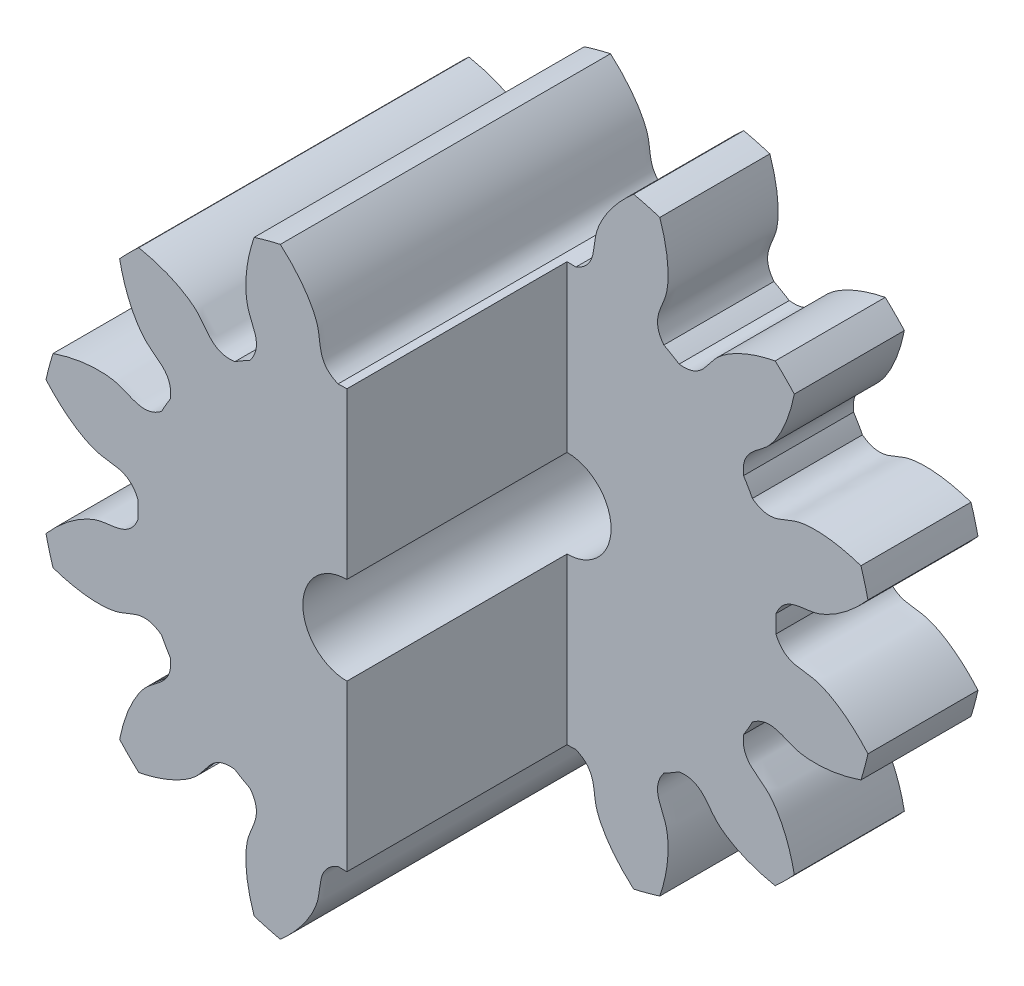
from build123d import *

# Parameters (mm, degrees)
SKETCH_1_R               = 14
EXTRUDE_1_DEPTH          = 15
CUT_EXTRUDE_1_DEPTH      = 25.839484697
PATTERN_CIRCULAR_1_COUNT = 12
CUT_EXTRUDE_START        = -10
CUT_EXTRUDE_3_DEPTH      = 10
CUT_EXTRUDE_4_REACH      = 26.468
SKETCH_4_R               = 2


with BuildPart() as part:
    # Sketch 1 → Extrude 1 (new body)
    with BuildSketch(Plane.XY):
        Circle(SKETCH_1_R)
    extrude(amount=EXTRUDE_1_DEPTH)

    # Sketch 2 → Cut-Extrude 1 (cut, through all)
    with BuildSketch(Plane.XY):
        with BuildLine():
            ThreePointArc((0.401680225, 9.491504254), (0, 9.5), (-0.401680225, 9.491504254))
            add(Edge.make_bspline(
                [(-0.401680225, 9.491504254), (-1.361577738, 9.898614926), (-1.148746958, 10.689637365), (-1.352304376, 11.378961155), (-1.365247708, 11.419811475), (-1.380454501, 11.46466685), (-1.398085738, 11.513452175), (-1.41830525, 11.566086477), (-1.441273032, 11.622484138), (-1.467147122, 11.682554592), (-1.496082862, 11.746202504), (-1.528232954, 11.813327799), (-1.563747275, 11.883825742), (-1.602772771, 11.957587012), (-1.645453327, 12.034497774), (-1.691929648, 12.114439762), (-1.742339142, 12.197290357), (-1.796815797, 12.282922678), (-1.855490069, 12.371205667), (-1.918488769, 12.462004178), (-1.985934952, 12.555179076), (-2.057947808, 12.650587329), (-2.134642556, 12.748082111), (-2.216130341, 12.847512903), (-2.302518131, 12.948725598), (-2.39390862, 13.051562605), (-2.490400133, 13.155862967), (-2.59208653, 13.261462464), (-2.699057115, 13.368193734), (-2.811396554, 13.475886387), (-2.929184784, 13.584367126), (-3.052496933, 13.693459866), (-3.181403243, 13.802985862), (-3.31596899, 13.912763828), (-3.456254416, 14.02261007), (-3.602314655, 14.132338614), (-3.754199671, 14.241761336), (-3.911954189, 14.350688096), (-4.07561764, 14.458926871), (-4.2452241, 14.566283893), (-4.420802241, 14.672563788), (-4.602375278, 14.77756971), (-4.789960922, 14.881103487), (-4.983571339, 14.98296576), (-5.183213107, 15.082956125), (-5.388887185, 15.18087328), (-5.600588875, 15.276515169), (-5.818307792, 15.369679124), (-6.042027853, 15.460162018), (-6.27172721, 15.547760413), (-6.588759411, 15.661455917), (-6.8311872, 15.740202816), (-6.995210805, 15.78994182)],
                knots=[0, 0, 0, 0, 0.218015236, 0.222043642, 0.226545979, 0.231522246, 0.236972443, 0.24289657, 0.249294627, 0.256166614, 0.263512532, 0.271332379, 0.279626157, 0.288393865, 0.297635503, 0.307351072, 0.31754057, 0.328203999, 0.339341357, 0.350952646, 0.363037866, 0.375597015, 0.388630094, 0.402137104, 0.416118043, 0.430572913, 0.445501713, 0.460904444, 0.476781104, 0.493131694, 0.509956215, 0.527254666, 0.545027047, 0.563273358, 0.581993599, 0.601187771, 0.620855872, 0.640997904, 0.661613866, 0.682703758, 0.704267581, 0.726305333, 0.748817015, 0.771802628, 0.795262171, 0.819195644, 0.843603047, 0.868484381, 0.893839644, 0.919668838, 0.945971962, 1, 1, 1, 1], degree=3))
            ThreePointArc((-6.995210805, 15.78994182), (0, 17.270067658), (6.995210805, 15.78994182))
            add(Edge.make_bspline(
                [(0.401680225, 9.491504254), (1.361577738, 9.898614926), (1.148746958, 10.689637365), (1.352304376, 11.378961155), (1.365247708, 11.419811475), (1.380454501, 11.46466685), (1.398085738, 11.513452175), (1.41830525, 11.566086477), (1.441273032, 11.622484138), (1.467147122, 11.682554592), (1.496082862, 11.746202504), (1.528232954, 11.813327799), (1.563747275, 11.883825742), (1.602772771, 11.957587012), (1.645453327, 12.034497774), (1.691929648, 12.114439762), (1.742339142, 12.197290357), (1.796815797, 12.282922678), (1.855490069, 12.371205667), (1.918488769, 12.462004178), (1.985934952, 12.555179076), (2.057947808, 12.650587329), (2.134642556, 12.748082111), (2.216130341, 12.847512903), (2.302518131, 12.948725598), (2.39390862, 13.051562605), (2.490400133, 13.155862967), (2.59208653, 13.261462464), (2.699057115, 13.368193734), (2.811396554, 13.475886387), (2.929184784, 13.584367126), (3.052496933, 13.693459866), (3.181403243, 13.802985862), (3.31596899, 13.912763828), (3.456254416, 14.02261007), (3.602314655, 14.132338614), (3.754199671, 14.241761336), (3.911954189, 14.350688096), (4.07561764, 14.458926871), (4.2452241, 14.566283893), (4.420802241, 14.672563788), (4.602375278, 14.77756971), (4.789960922, 14.881103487), (4.983571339, 14.98296576), (5.183213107, 15.082956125), (5.388887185, 15.18087328), (5.600588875, 15.276515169), (5.818307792, 15.369679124), (6.042027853, 15.460162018), (6.27172721, 15.547760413), (6.588759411, 15.661455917), (6.8311872, 15.740202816), (6.995210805, 15.78994182)],
                knots=[0, 0, 0, 0, 0.218015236, 0.222043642, 0.226545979, 0.231522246, 0.236972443, 0.24289657, 0.249294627, 0.256166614, 0.263512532, 0.271332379, 0.279626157, 0.288393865, 0.297635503, 0.307351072, 0.31754057, 0.328203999, 0.339341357, 0.350952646, 0.363037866, 0.375597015, 0.388630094, 0.402137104, 0.416118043, 0.430572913, 0.445501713, 0.460904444, 0.476781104, 0.493131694, 0.509956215, 0.527254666, 0.545027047, 0.563273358, 0.581993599, 0.601187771, 0.620855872, 0.640997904, 0.661613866, 0.682703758, 0.704267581, 0.726305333, 0.748817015, 0.771802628, 0.795262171, 0.819195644, 0.843603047, 0.868484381, 0.893839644, 0.919668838, 0.945971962, 1, 1, 1, 1], degree=3))
        make_face()
    cut_extrude_1 = extrude(amount=CUT_EXTRUDE_1_DEPTH, mode=Mode.SUBTRACT)

    # Pattern Circular 1: Cut-Extrude 1 ×12 about axis
    pattern_circular_1_axis = Axis((0, 0, 15), (0, 0, -1))
    for i in range(1, PATTERN_CIRCULAR_1_COUNT):
        add(cut_extrude_1.rotate(pattern_circular_1_axis, i * 360 / PATTERN_CIRCULAR_1_COUNT), mode=Mode.SUBTRACT)

    # Sketch 6 → Cut-Extrude 3 (cut)
    with BuildSketch(Plane.XY.offset(15).offset(CUT_EXTRUDE_START)):
        with BuildLine():
            Line((0, 14), (0, -14))
            ThreePointArc((0, -14), (14, 0), (0, 14))
        make_face()
    extrude(amount=CUT_EXTRUDE_3_DEPTH, mode=Mode.SUBTRACT)

    # Cut-Extrude 4: up to this face of the body (flat: up to its plane)
    cut_extrude_4_end = Plane(part.part.faces().sort_by_distance((0, 0, 0))[0])
    # Sketch 4 → Cut-Extrude 4 (cut, up to the picked face)
    with BuildSketch(Plane.XY.offset(15), mode=Mode.PRIVATE) as cut_extrude_4_sk1:
        Circle(SKETCH_4_R)
    cut_extrude_4_tool1 = split(extrude(cut_extrude_4_sk1.sketch, amount=-CUT_EXTRUDE_4_REACH, mode=Mode.PRIVATE), bisect_by=cut_extrude_4_end, keep=Keep.BOTH, mode=Mode.PRIVATE)
    add(cut_extrude_4_tool1.solids().sort_by(Axis((0, 0, 15), (0, 0, -1)))[0], mode=Mode.SUBTRACT)


solid = part.part
